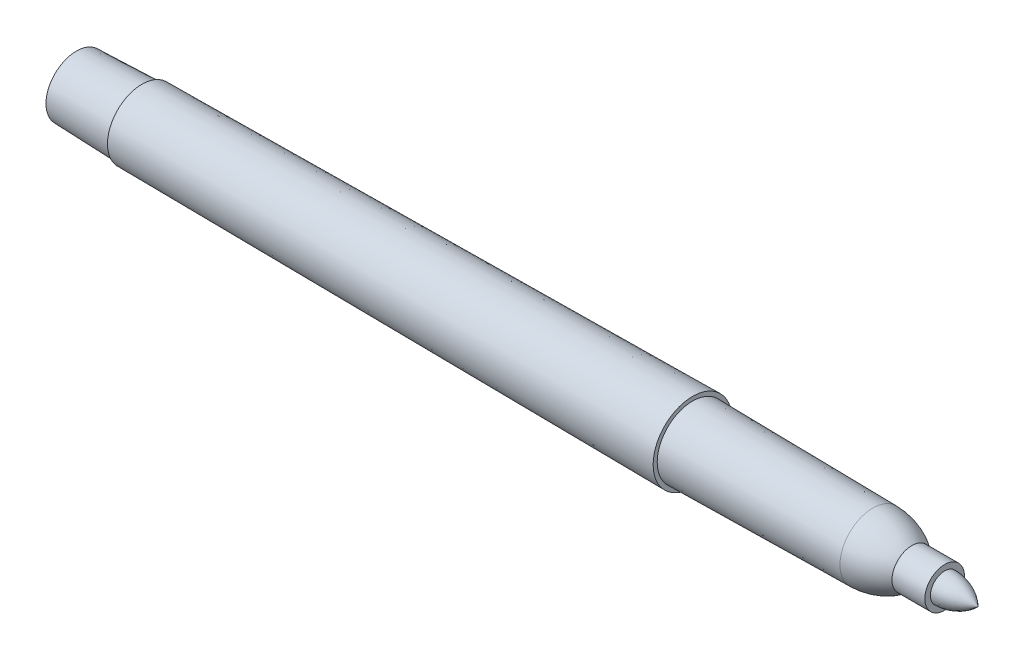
ISO-10303-21;
HEADER;
FILE_DESCRIPTION(('STEP AP214'),'2;1');
FILE_NAME('part.step','',(''),(''),'','','');
FILE_SCHEMA(('AUTOMOTIVE_DESIGN { 1 0 10303 214 1 1 1 1 }'));
ENDSEC;
DATA;
#1=APPLICATION_CONTEXT('core data for automotive mechanical design processes');
#2=APPLICATION_PROTOCOL_DEFINITION('international standard','automotive_design',2000,#1);
#3=PRODUCT_CONTEXT('',#1,'mechanical');
#4=PRODUCT('Part','Part','',(#3));
#5=PRODUCT_RELATED_PRODUCT_CATEGORY('part','',(#4));
#6=PRODUCT_DEFINITION_FORMATION('','',#4);
#7=PRODUCT_DEFINITION_CONTEXT('part definition',#1,'design');
#8=PRODUCT_DEFINITION('design','',#6,#7);
#9=PRODUCT_DEFINITION_SHAPE('','',#8);
#10=(LENGTH_UNIT() NAMED_UNIT(*) SI_UNIT(.MILLI.,.METRE.));
#11=(NAMED_UNIT(*) PLANE_ANGLE_UNIT() SI_UNIT($,.RADIAN.));
#12=(NAMED_UNIT(*) SI_UNIT($,.STERADIAN.) SOLID_ANGLE_UNIT());
#13=UNCERTAINTY_MEASURE_WITH_UNIT(LENGTH_MEASURE(1.E-05),#10,'distance_accuracy_value','');
#14=(GEOMETRIC_REPRESENTATION_CONTEXT(3) GLOBAL_UNCERTAINTY_ASSIGNED_CONTEXT((#13)) GLOBAL_UNIT_ASSIGNED_CONTEXT((#10,
#11,#12)) REPRESENTATION_CONTEXT('',''));
#15=CARTESIAN_POINT('',(0.,0.,0.));
#16=DIRECTION('',(0.,0.,1.));
#17=DIRECTION('',(1.,0.,0.));
#18=AXIS2_PLACEMENT_3D('',#15,#16,#17);
#19=CARTESIAN_POINT('',(0.,0.,0.));
#20=DIRECTION('',(1.,0.,0.));
#21=DIRECTION('',(0.,0.,-1.));
#22=AXIS2_PLACEMENT_3D('',#19,#20,#21);
#23=PLANE('',#22);
#24=CARTESIAN_POINT('',(0.,0.,0.));
#25=DIRECTION('',(-1.,0.,0.));
#26=DIRECTION('',(0.,0.,1.));
#27=AXIS2_PLACEMENT_3D('',#24,#25,#26);
#28=CIRCLE('',#27,4.2799);
#29=CARTESIAN_POINT('',(0.,0.,4.2799));
#30=VERTEX_POINT('',#29);
#31=EDGE_CURVE('E11',#30,#30,#28,.T.);
#32=ORIENTED_EDGE('',*,*,#31,.T.);
#33=EDGE_LOOP('',(#32));
#34=FACE_BOUND('',#33,.T.);
#35=ADVANCED_FACE('F45',(#34),#23,.F.);
#36=CARTESIAN_POINT('',(9.2456,0.,0.));
#37=DIRECTION('',(1.,0.,0.));
#38=DIRECTION('',(0.,0.,-1.));
#39=AXIS2_PLACEMENT_3D('',#36,#37,#38);
#40=CONICAL_SURFACE('',#39,4.5847,0.032955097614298);
#41=ORIENTED_EDGE('',*,*,#31,.F.);
#42=EDGE_LOOP('',(#41));
#43=FACE_BOUND('',#42,.T.);
#44=CARTESIAN_POINT('',(9.2456,0.,0.));
#45=DIRECTION('',(-1.,0.,0.));
#46=DIRECTION('',(0.,0.,1.));
#47=AXIS2_PLACEMENT_3D('',#44,#45,#46);
#48=CIRCLE('',#47,4.5847);
#49=CARTESIAN_POINT('',(9.2456,0.,4.5847));
#50=VERTEX_POINT('',#49);
#51=EDGE_CURVE('E52',#50,#50,#48,.T.);
#52=ORIENTED_EDGE('',*,*,#51,.T.);
#53=EDGE_LOOP('',(#52));
#54=FACE_BOUND('',#53,.T.);
#55=ADVANCED_FACE('F68',(#43,#54),#40,.T.);
#56=CARTESIAN_POINT('',(9.2456,0.,-4.5847));
#57=DIRECTION('',(1.,0.,0.));
#58=DIRECTION('',(0.,0.,-1.));
#59=AXIS2_PLACEMENT_3D('',#56,#57,#58);
#60=PLANE('',#59);
#61=ORIENTED_EDGE('',*,*,#51,.F.);
#62=EDGE_LOOP('',(#61));
#63=FACE_BOUND('',#62,.T.);
#64=CARTESIAN_POINT('',(9.2456,0.,0.));
#65=DIRECTION('',(-1.,0.,0.));
#66=DIRECTION('',(0.,0.,1.));
#67=AXIS2_PLACEMENT_3D('',#64,#65,#66);
#68=CIRCLE('',#67,4.8641);
#69=CARTESIAN_POINT('',(9.2456,0.,4.8641));
#70=VERTEX_POINT('',#69);
#71=EDGE_CURVE('E81',#70,#70,#68,.T.);
#72=ORIENTED_EDGE('',*,*,#71,.T.);
#73=EDGE_LOOP('',(#72));
#74=FACE_BOUND('',#73,.T.);
#75=ADVANCED_FACE('F73',(#63,#74),#60,.F.);
#76=CARTESIAN_POINT('',(86.7918,0.,0.));
#77=DIRECTION('',(1.,0.,0.));
#78=DIRECTION('',(0.,0.,-1.));
#79=AXIS2_PLACEMENT_3D('',#76,#77,#78);
#80=CONICAL_SURFACE('',#79,5.5499,0.00884352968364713);
#81=ORIENTED_EDGE('',*,*,#71,.F.);
#82=EDGE_LOOP('',(#81));
#83=FACE_BOUND('',#82,.T.);
#84=CARTESIAN_POINT('',(86.7918,0.,0.));
#85=DIRECTION('',(-1.,0.,0.));
#86=DIRECTION('',(0.,0.,1.));
#87=AXIS2_PLACEMENT_3D('',#84,#85,#86);
#88=CIRCLE('',#87,5.5499);
#89=CARTESIAN_POINT('',(86.7918,0.,5.5499));
#90=VERTEX_POINT('',#89);
#91=EDGE_CURVE('E84',#90,#90,#88,.T.);
#92=ORIENTED_EDGE('',*,*,#91,.T.);
#93=EDGE_LOOP('',(#92));
#94=FACE_BOUND('',#93,.T.);
#95=ADVANCED_FACE('F130',(#83,#94),#80,.T.);
#96=CARTESIAN_POINT('',(86.7918,0.,-4.9784));
#97=DIRECTION('',(-1.,0.,0.));
#98=DIRECTION('',(0.,0.,1.));
#99=AXIS2_PLACEMENT_3D('',#96,#97,#98);
#100=PLANE('',#99);
#101=ORIENTED_EDGE('',*,*,#91,.F.);
#102=EDGE_LOOP('',(#101));
#103=FACE_BOUND('',#102,.T.);
#104=CARTESIAN_POINT('',(86.7918,0.,0.));
#105=DIRECTION('',(-1.,0.,0.));
#106=DIRECTION('',(0.,0.,1.));
#107=AXIS2_PLACEMENT_3D('',#104,#105,#106);
#108=CIRCLE('',#107,4.9784);
#109=CARTESIAN_POINT('',(86.7918,0.,4.9784));
#110=VERTEX_POINT('',#109);
#111=EDGE_CURVE('E90',#110,#110,#108,.T.);
#112=ORIENTED_EDGE('',*,*,#111,.T.);
#113=EDGE_LOOP('',(#112));
#114=FACE_BOUND('',#113,.T.);
#115=ADVANCED_FACE('F126',(#103,#114),#100,.F.);
#116=CARTESIAN_POINT('',(112.1918,0.,0.));
#117=DIRECTION('',(-1.,0.,0.));
#118=DIRECTION('',(0.,0.,1.));
#119=AXIS2_PLACEMENT_3D('',#116,#117,#118);
#120=CONICAL_SURFACE('',#119,4.6355,0.013499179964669);
#121=ORIENTED_EDGE('',*,*,#111,.F.);
#122=EDGE_LOOP('',(#121));
#123=FACE_BOUND('',#122,.T.);
#124=CARTESIAN_POINT('',(112.1918,0.,0.));
#125=DIRECTION('',(-1.,0.,0.));
#126=DIRECTION('',(0.,0.,1.));
#127=AXIS2_PLACEMENT_3D('',#124,#125,#126);
#128=CIRCLE('',#127,4.6355);
#129=CARTESIAN_POINT('',(112.1918,0.,4.6355));
#130=VERTEX_POINT('',#129);
#131=EDGE_CURVE('E94',#130,#130,#128,.T.);
#132=ORIENTED_EDGE('',*,*,#131,.T.);
#133=EDGE_LOOP('',(#132));
#134=FACE_BOUND('',#133,.T.);
#135=ADVANCED_FACE('F119',(#123,#134),#120,.T.);
#136=CARTESIAN_POINT('',(112.063891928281,0.,0.));
#137=DIRECTION('',(-1.,0.,0.));
#138=DIRECTION('',(0.,0.,1.));
#139=AXIS2_PLACEMENT_3D('',#136,#137,#138);
#140=DEGENERATE_TOROIDAL_SURFACE('',#139,4.83917197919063,9.47553531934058,.F.);
#141=ORIENTED_EDGE('',*,*,#131,.F.);
#142=EDGE_LOOP('',(#141));
#143=FACE_BOUND('',#142,.T.);
#144=CARTESIAN_POINT('',(117.6782,0.,0.));
#145=DIRECTION('',(-1.,0.,0.));
#146=DIRECTION('',(0.,0.,1.));
#147=AXIS2_PLACEMENT_3D('',#144,#145,#146);
#148=CIRCLE('',#147,2.794);
#149=CARTESIAN_POINT('',(117.6782,0.,2.794));
#150=VERTEX_POINT('',#149);
#151=EDGE_CURVE('E98',#150,#150,#148,.T.);
#152=ORIENTED_EDGE('',*,*,#151,.T.);
#153=EDGE_LOOP('',(#152));
#154=FACE_BOUND('',#153,.T.);
#155=ADVANCED_FACE('F113',(#143,#154),#140,.F.);
#156=CARTESIAN_POINT('',(0.,0.,0.));
#157=DIRECTION('',(-1.,0.,0.));
#158=DIRECTION('',(0.,0.,1.));
#159=AXIS2_PLACEMENT_3D('',#156,#157,#158);
#160=CYLINDRICAL_SURFACE('',#159,2.794);
#161=ORIENTED_EDGE('',*,*,#151,.F.);
#162=EDGE_LOOP('',(#161));
#163=FACE_BOUND('',#162,.T.);
#164=CARTESIAN_POINT('',(122.301,0.,0.));
#165=DIRECTION('',(-1.,0.,0.));
#166=DIRECTION('',(0.,0.,1.));
#167=AXIS2_PLACEMENT_3D('',#164,#165,#166);
#168=CIRCLE('',#167,2.794);
#169=CARTESIAN_POINT('',(122.301,0.,2.794));
#170=VERTEX_POINT('',#169);
#171=EDGE_CURVE('E102',#170,#170,#168,.T.);
#172=ORIENTED_EDGE('',*,*,#171,.T.);
#173=EDGE_LOOP('',(#172));
#174=FACE_BOUND('',#173,.T.);
#175=ADVANCED_FACE('F63',(#163,#174),#160,.T.);
#176=CARTESIAN_POINT('',(122.301,0.,-2.0066));
#177=DIRECTION('',(-1.,0.,0.));
#178=DIRECTION('',(0.,0.,1.));
#179=AXIS2_PLACEMENT_3D('',#176,#177,#178);
#180=PLANE('',#179);
#181=ORIENTED_EDGE('',*,*,#171,.F.);
#182=EDGE_LOOP('',(#181));
#183=FACE_BOUND('',#182,.T.);
#184=CARTESIAN_POINT('',(122.301,0.,0.));
#185=DIRECTION('',(-1.,0.,0.));
#186=DIRECTION('',(0.,0.,1.));
#187=AXIS2_PLACEMENT_3D('',#184,#185,#186);
#188=CIRCLE('',#187,2.0066);
#189=CARTESIAN_POINT('',(122.301,0.,2.0066));
#190=VERTEX_POINT('',#189);
#191=EDGE_CURVE('E106',#190,#190,#188,.T.);
#192=ORIENTED_EDGE('',*,*,#191,.T.);
#193=EDGE_LOOP('',(#192));
#194=FACE_BOUND('',#193,.T.);
#195=ADVANCED_FACE('F57',(#183,#194),#180,.F.);
#196=CARTESIAN_POINT('',(122.258344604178,0.,-4.5985828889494));
#197=DIRECTION('',(0.,-1.,0.));
#198=DIRECTION('',(0.,0.,1.));
#199=AXIS2_PLACEMENT_3D('',#196,#197,#198);
#200=CIRCLE('',#199,6.60532061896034);
#201=TRIMMED_CURVE('',#200,(PARAMETER_VALUE(-0.800714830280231)),
(PARAMETER_VALUE(0.800714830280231)),.T.,.PARAMETER.);
#202=CARTESIAN_POINT('',(122.258344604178,0.,0.));
#203=DIRECTION('',(-1.,0.,0.));
#204=AXIS1_PLACEMENT('',#202,#203);
#205=SURFACE_OF_REVOLUTION('',#201,#204);
#206=ORIENTED_EDGE('',*,*,#191,.F.);
#207=EDGE_LOOP('',(#206));
#208=FACE_BOUND('',#207,.T.);
#209=CARTESIAN_POINT('',(127.,0.,0.));
#210=VERTEX_POINT('',#209);
#211=VERTEX_LOOP('',#210);
#212=FACE_BOUND('',#211,.T.);
#213=ADVANCED_FACE('F55',(#208,#212),#205,.T.);
#214=CLOSED_SHELL('',(#35,#55,#75,#95,#115,#135,#155,#175,#195,#213));
#215=MANIFOLD_SOLID_BREP('B2',#214);
#216=ADVANCED_BREP_SHAPE_REPRESENTATION('',(#18,#215),#14);
#217=SHAPE_DEFINITION_REPRESENTATION(#9,#216);
ENDSEC;
END-ISO-10303-21;
